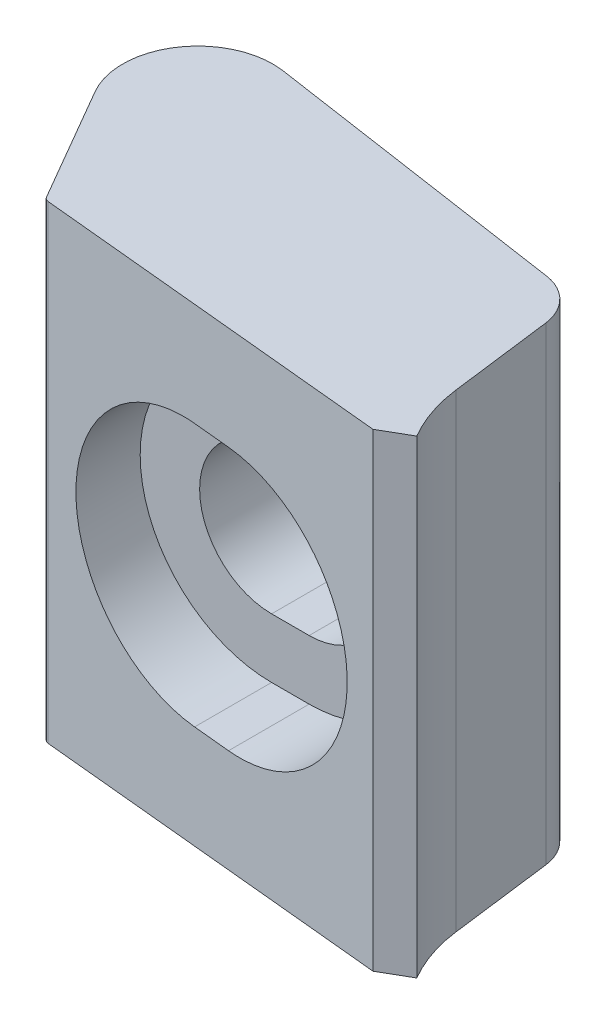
ISO-10303-21;
HEADER;
FILE_DESCRIPTION(('STEP AP214'),'2;1');
FILE_NAME('part.step','',(''),(''),'','','');
FILE_SCHEMA(('AUTOMOTIVE_DESIGN { 1 0 10303 214 1 1 1 1 }'));
ENDSEC;
DATA;
#1=APPLICATION_CONTEXT('core data for automotive mechanical design processes');
#2=APPLICATION_PROTOCOL_DEFINITION('international standard','automotive_design',2000,#1);
#3=PRODUCT_CONTEXT('',#1,'mechanical');
#4=PRODUCT('Part','Part','',(#3));
#5=PRODUCT_RELATED_PRODUCT_CATEGORY('part','',(#4));
#6=PRODUCT_DEFINITION_FORMATION('','',#4);
#7=PRODUCT_DEFINITION_CONTEXT('part definition',#1,'design');
#8=PRODUCT_DEFINITION('design','',#6,#7);
#9=PRODUCT_DEFINITION_SHAPE('','',#8);
#10=(LENGTH_UNIT() NAMED_UNIT(*) SI_UNIT(.MILLI.,.METRE.));
#11=(NAMED_UNIT(*) PLANE_ANGLE_UNIT() SI_UNIT($,.RADIAN.));
#12=(NAMED_UNIT(*) SI_UNIT($,.STERADIAN.) SOLID_ANGLE_UNIT());
#13=UNCERTAINTY_MEASURE_WITH_UNIT(LENGTH_MEASURE(1.E-05),#10,'distance_accuracy_value','');
#14=(GEOMETRIC_REPRESENTATION_CONTEXT(3) GLOBAL_UNCERTAINTY_ASSIGNED_CONTEXT((#13)) GLOBAL_UNIT_ASSIGNED_CONTEXT((#10,
#11,#12)) REPRESENTATION_CONTEXT('',''));
#15=CARTESIAN_POINT('',(0.,0.,0.));
#16=DIRECTION('',(0.,0.,1.));
#17=DIRECTION('',(1.,0.,0.));
#18=AXIS2_PLACEMENT_3D('',#15,#16,#17);
#19=CARTESIAN_POINT('',(6.5478797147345,4.7625,3.47218));
#20=DIRECTION('',(0.,-1.,0.));
#21=DIRECTION('',(1.,0.,0.));
#22=AXIS2_PLACEMENT_3D('',#19,#20,#21);
#23=CYLINDRICAL_SURFACE('',#22,3.175);
#24=CARTESIAN_POINT('',(6.5478797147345,-4.7625,3.47218));
#25=DIRECTION('',(0.,-1.,0.));
#26=DIRECTION('',(-1.,0.,0.));
#27=AXIS2_PLACEMENT_3D('',#24,#25,#26);
#28=CIRCLE('',#27,3.175);
#29=CARTESIAN_POINT('',(3.81,-4.7625,5.07986145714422));
#30=VERTEX_POINT('',#29);
#31=CARTESIAN_POINT('',(3.39844189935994,-4.7625,3.87425766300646));
#32=VERTEX_POINT('',#31);
#33=EDGE_CURVE('E185',#30,#32,#28,.T.);
#34=ORIENTED_EDGE('',*,*,#33,.T.);
#35=DIRECTION('',(0.,-1.,0.));
#36=VECTOR('',#35,1.);
#37=CARTESIAN_POINT('',(3.39844189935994,4.7625,3.87425766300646));
#38=LINE('',#37,#36);
#39=CARTESIAN_POINT('',(3.39844189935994,4.7625,3.87425766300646));
#40=VERTEX_POINT('',#39);
#41=EDGE_CURVE('E251',#40,#32,#38,.T.);
#42=ORIENTED_EDGE('',*,*,#41,.F.);
#43=CARTESIAN_POINT('',(6.5478797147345,4.7625,3.47218));
#44=DIRECTION('',(0.,-1.,0.));
#45=DIRECTION('',(-1.,0.,0.));
#46=AXIS2_PLACEMENT_3D('',#43,#44,#45);
#47=CIRCLE('',#46,3.175);
#48=CARTESIAN_POINT('',(3.81,4.7625,5.07986145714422));
#49=VERTEX_POINT('',#48);
#50=EDGE_CURVE('E213',#49,#40,#47,.T.);
#51=ORIENTED_EDGE('',*,*,#50,.F.);
#52=DIRECTION('',(0.,-1.,0.));
#53=VECTOR('',#52,1.);
#54=CARTESIAN_POINT('',(3.81,4.7625,5.07986145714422));
#55=LINE('',#54,#53);
#56=EDGE_CURVE('E254',#49,#30,#55,.T.);
#57=ORIENTED_EDGE('',*,*,#56,.T.);
#58=EDGE_LOOP('',(#34,#42,#51,#57));
#59=FACE_BOUND('',#58,.T.);
#60=ADVANCED_FACE('F14',(#59),#23,.F.);
#61=CARTESIAN_POINT('',(3.39844189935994,4.7625,3.87425766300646));
#62=DIRECTION('',(-0.991948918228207,0.,0.126638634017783));
#63=DIRECTION('',(0.126638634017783,0.,0.991948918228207));
#64=AXIS2_PLACEMENT_3D('',#61,#62,#63);
#65=PLANE('',#64);
#66=DIRECTION('',(-0.126638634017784,0.,-0.991948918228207));
#67=VECTOR('',#66,1.);
#68=CARTESIAN_POINT('',(3.39844189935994,-4.7625,3.87425766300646));
#69=LINE('',#68,#67);
#70=CARTESIAN_POINT('',(3.13142881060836,-4.7625,1.78276839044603));
#71=VERTEX_POINT('',#70);
#72=EDGE_CURVE('E194',#32,#71,#69,.T.);
#73=ORIENTED_EDGE('',*,*,#72,.T.);
#74=DIRECTION('',(0.,-1.,0.));
#75=VECTOR('',#74,1.);
#76=CARTESIAN_POINT('',(3.13142881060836,4.7625,1.78276839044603));
#77=LINE('',#76,#75);
#78=CARTESIAN_POINT('',(3.13142881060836,4.7625,1.78276839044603));
#79=VERTEX_POINT('',#78);
#80=EDGE_CURVE('E248',#79,#71,#77,.T.);
#81=ORIENTED_EDGE('',*,*,#80,.F.);
#82=DIRECTION('',(-0.126638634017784,0.,-0.991948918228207));
#83=VECTOR('',#82,1.);
#84=CARTESIAN_POINT('',(3.39844189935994,4.7625,3.87425766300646));
#85=LINE('',#84,#83);
#86=EDGE_CURVE('E215',#40,#79,#85,.T.);
#87=ORIENTED_EDGE('',*,*,#86,.F.);
#88=ORIENTED_EDGE('',*,*,#41,.T.);
#89=EDGE_LOOP('',(#73,#81,#87,#88));
#90=FACE_BOUND('',#89,.T.);
#91=ADVANCED_FACE('F292',(#90),#65,.F.);
#92=CARTESIAN_POINT('',(2.1739997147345,4.7625,1.905));
#93=DIRECTION('',(0.,-1.,0.));
#94=DIRECTION('',(1.,0.,0.));
#95=AXIS2_PLACEMENT_3D('',#92,#93,#94);
#96=CYLINDRICAL_SURFACE('',#95,0.9652);
#97=CARTESIAN_POINT('',(2.1739997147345,-4.7625,1.905));
#98=DIRECTION('',(0.,1.,0.));
#99=DIRECTION('',(-1.,0.,0.));
#100=AXIS2_PLACEMENT_3D('',#97,#98,#99);
#101=CIRCLE('',#100,0.9652);
#102=CARTESIAN_POINT('',(2.31587971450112,-4.7625,0.95028480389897));
#103=VERTEX_POINT('',#102);
#104=EDGE_CURVE('E196',#71,#103,#101,.T.);
#105=ORIENTED_EDGE('',*,*,#104,.T.);
#106=DIRECTION('',(0.,-1.,0.));
#107=VECTOR('',#106,1.);
#108=CARTESIAN_POINT('',(2.31587971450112,4.7625,0.95028480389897));
#109=LINE('',#108,#107);
#110=CARTESIAN_POINT('',(2.31587971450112,4.7625,0.95028480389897));
#111=VERTEX_POINT('',#110);
#112=EDGE_CURVE('E245',#111,#103,#109,.T.);
#113=ORIENTED_EDGE('',*,*,#112,.F.);
#114=CARTESIAN_POINT('',(2.1739997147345,4.7625,1.905));
#115=DIRECTION('',(0.,1.,0.));
#116=DIRECTION('',(-1.,0.,0.));
#117=AXIS2_PLACEMENT_3D('',#114,#115,#116);
#118=CIRCLE('',#117,0.9652);
#119=EDGE_CURVE('E217',#79,#111,#118,.T.);
#120=ORIENTED_EDGE('',*,*,#119,.F.);
#121=ORIENTED_EDGE('',*,*,#80,.T.);
#122=EDGE_LOOP('',(#105,#113,#120,#121));
#123=FACE_BOUND('',#122,.T.);
#124=ADVANCED_FACE('F298',(#123),#96,.T.);
#125=CARTESIAN_POINT('',(-3.96721923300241,4.7625,0.0165549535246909));
#126=DIRECTION('',(-0.146995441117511,0.,0.98913716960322));
#127=DIRECTION('',(0.98913716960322,0.,0.146995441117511));
#128=AXIS2_PLACEMENT_3D('',#125,#126,#127);
#129=PLANE('',#128);
#130=DIRECTION('',(0.98913716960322,0.,0.146995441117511));
#131=VECTOR('',#130,1.);
#132=CARTESIAN_POINT('',(-3.96721923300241,-1.4605,0.0165549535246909));
#133=LINE('',#132,#131);
#134=CARTESIAN_POINT('',(-0.762,-1.4605,0.492881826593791));
#135=VERTEX_POINT('',#134);
#136=CARTESIAN_POINT('',(0.,-1.4605,0.606122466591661));
#137=VERTEX_POINT('',#136);
#138=EDGE_CURVE('E163',#135,#137,#133,.T.);
#139=ORIENTED_EDGE('',*,*,#138,.T.);
#140=CARTESIAN_POINT('',(0.,0.,0.606122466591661));
#141=DIRECTION('',(-0.146995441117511,0.,0.98913716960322));
#142=DIRECTION('',(0.98913716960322,0.,0.146995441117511));
#143=AXIS2_PLACEMENT_3D('',#140,#141,#142);
#144=ELLIPSE('',#143,1.47653939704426,1.4605);
#145=CARTESIAN_POINT('',(0.,1.4605,0.606122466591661));
#146=VERTEX_POINT('',#145);
#147=EDGE_CURVE('E166',#137,#146,#144,.T.);
#148=ORIENTED_EDGE('',*,*,#147,.T.);
#149=DIRECTION('',(-0.98913716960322,0.,-0.146995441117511));
#150=VECTOR('',#149,1.);
#151=CARTESIAN_POINT('',(-3.96721923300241,1.4605,0.0165549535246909));
#152=LINE('',#151,#150);
#153=CARTESIAN_POINT('',(-0.762,1.4605,0.492881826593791));
#154=VERTEX_POINT('',#153);
#155=EDGE_CURVE('E158',#146,#154,#152,.T.);
#156=ORIENTED_EDGE('',*,*,#155,.T.);
#157=CARTESIAN_POINT('',(-0.762,0.,0.492881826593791));
#158=DIRECTION('',(-0.146995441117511,0.,0.98913716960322));
#159=DIRECTION('',(0.98913716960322,0.,0.146995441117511));
#160=AXIS2_PLACEMENT_3D('',#157,#158,#159);
#161=ELLIPSE('',#160,1.47653939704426,1.4605);
#162=EDGE_CURVE('E138',#154,#135,#161,.T.);
#163=ORIENTED_EDGE('',*,*,#162,.T.);
#164=EDGE_LOOP('',(#139,#148,#156,#163));
#165=FACE_BOUND('',#164,.T.);
#166=DIRECTION('',(-0.98913716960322,0.,-0.146995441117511));
#167=VECTOR('',#166,1.);
#168=CARTESIAN_POINT('',(-3.96721923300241,-4.7625,0.0165549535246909));
#169=LINE('',#168,#167);
#170=CARTESIAN_POINT('',(-3.96721923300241,-4.7625,0.0165549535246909));
#171=VERTEX_POINT('',#170);
#172=EDGE_CURVE('E198',#103,#171,#169,.T.);
#173=ORIENTED_EDGE('',*,*,#172,.T.);
#174=DIRECTION('',(0.,-1.,0.));
#175=VECTOR('',#174,1.);
#176=CARTESIAN_POINT('',(-3.96721923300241,4.7625,0.0165549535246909));
#177=LINE('',#176,#175);
#178=CARTESIAN_POINT('',(-3.96721923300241,4.7625,0.0165549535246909));
#179=VERTEX_POINT('',#178);
#180=EDGE_CURVE('E242',#179,#171,#177,.T.);
#181=ORIENTED_EDGE('',*,*,#180,.F.);
#182=DIRECTION('',(-0.98913716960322,0.,-0.146995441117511));
#183=VECTOR('',#182,1.);
#184=CARTESIAN_POINT('',(-3.96721923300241,4.7625,0.0165549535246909));
#185=LINE('',#184,#183);
#186=EDGE_CURVE('E219',#111,#179,#185,.T.);
#187=ORIENTED_EDGE('',*,*,#186,.F.);
#188=ORIENTED_EDGE('',*,*,#112,.T.);
#189=EDGE_LOOP('',(#173,#181,#187,#188));
#190=FACE_BOUND('',#189,.T.);
#191=ADVANCED_FACE('F317',(#165,#190),#129,.F.);
#192=CARTESIAN_POINT('',(-4.1912402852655,4.7625,1.524));
#193=DIRECTION('',(0.,-1.,0.));
#194=DIRECTION('',(1.,0.,0.));
#195=AXIS2_PLACEMENT_3D('',#192,#193,#194);
#196=CYLINDRICAL_SURFACE('',#195,1.524);
#197=CARTESIAN_POINT('',(-4.1912402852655,-4.7625,1.524));
#198=DIRECTION('',(0.,1.,0.));
#199=DIRECTION('',(-1.,0.,0.));
#200=AXIS2_PLACEMENT_3D('',#197,#198,#199);
#201=CIRCLE('',#200,1.524);
#202=CARTESIAN_POINT('',(-5.50966221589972,-4.7625,2.28842109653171));
#203=VERTEX_POINT('',#202);
#204=EDGE_CURVE('E200',#171,#203,#201,.T.);
#205=ORIENTED_EDGE('',*,*,#204,.T.);
#206=DIRECTION('',(0.,-1.,0.));
#207=VECTOR('',#206,1.);
#208=CARTESIAN_POINT('',(-5.50966221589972,4.7625,2.28842109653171));
#209=LINE('',#208,#207);
#210=CARTESIAN_POINT('',(-5.50966221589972,4.7625,2.28842109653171));
#211=VERTEX_POINT('',#210);
#212=EDGE_CURVE('E239',#211,#203,#209,.T.);
#213=ORIENTED_EDGE('',*,*,#212,.F.);
#214=CARTESIAN_POINT('',(-4.1912402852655,4.7625,1.524));
#215=DIRECTION('',(0.,1.,0.));
#216=DIRECTION('',(-1.,0.,0.));
#217=AXIS2_PLACEMENT_3D('',#214,#215,#216);
#218=CIRCLE('',#217,1.524);
#219=EDGE_CURVE('E221',#179,#211,#218,.T.);
#220=ORIENTED_EDGE('',*,*,#219,.F.);
#221=ORIENTED_EDGE('',*,*,#180,.T.);
#222=EDGE_LOOP('',(#205,#213,#220,#221));
#223=FACE_BOUND('',#222,.T.);
#224=ADVANCED_FACE('F339',(#223),#196,.T.);
#225=CARTESIAN_POINT('',(-4.14870877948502,4.7625,4.63570175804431));
#226=DIRECTION('',(0.865106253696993,0.,-0.501588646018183));
#227=DIRECTION('',(-0.501588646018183,0.,-0.865106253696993));
#228=AXIS2_PLACEMENT_3D('',#225,#226,#227);
#229=PLANE('',#228);
#230=DIRECTION('',(0.501588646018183,0.,0.865106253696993));
#231=VECTOR('',#230,1.);
#232=CARTESIAN_POINT('',(-4.14870877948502,-4.7625,4.63570175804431));
#233=LINE('',#232,#231);
#234=CARTESIAN_POINT('',(-4.14870877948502,-4.7625,4.63570175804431));
#235=VERTEX_POINT('',#234);
#236=EDGE_CURVE('E202',#203,#235,#233,.T.);
#237=ORIENTED_EDGE('',*,*,#236,.T.);
#238=DIRECTION('',(0.,-1.,0.));
#239=VECTOR('',#238,1.);
#240=CARTESIAN_POINT('',(-4.14870877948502,4.7625,4.63570175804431));
#241=LINE('',#240,#239);
#242=CARTESIAN_POINT('',(-4.14870877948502,4.7625,4.63570175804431));
#243=VERTEX_POINT('',#242);
#244=EDGE_CURVE('E236',#243,#235,#241,.T.);
#245=ORIENTED_EDGE('',*,*,#244,.F.);
#246=DIRECTION('',(0.501588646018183,0.,0.865106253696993));
#247=VECTOR('',#246,1.);
#248=CARTESIAN_POINT('',(-4.14870877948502,4.7625,4.63570175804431));
#249=LINE('',#248,#247);
#250=EDGE_CURVE('E223',#211,#243,#249,.T.);
#251=ORIENTED_EDGE('',*,*,#250,.F.);
#252=ORIENTED_EDGE('',*,*,#212,.T.);
#253=EDGE_LOOP('',(#237,#245,#251,#252));
#254=FACE_BOUND('',#253,.T.);
#255=ADVANCED_FACE('F337',(#254),#229,.F.);
#256=CARTESIAN_POINT('',(-4.0388402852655,4.7625,4.572));
#257=DIRECTION('',(0.,-1.,0.));
#258=DIRECTION('',(1.,0.,0.));
#259=AXIS2_PLACEMENT_3D('',#256,#257,#258);
#260=CYLINDRICAL_SURFACE('',#259,0.127);
#261=CARTESIAN_POINT('',(-4.0388402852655,-4.7625,4.572));
#262=DIRECTION('',(0.,1.,0.));
#263=DIRECTION('',(-1.,0.,0.));
#264=AXIS2_PLACEMENT_3D('',#261,#262,#263);
#265=CIRCLE('',#264,0.127);
#266=CARTESIAN_POINT('',(-4.05108296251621,-4.7625,4.6984085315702));
#267=VERTEX_POINT('',#266);
#268=EDGE_CURVE('E204',#235,#267,#265,.T.);
#269=ORIENTED_EDGE('',*,*,#268,.T.);
#270=DIRECTION('',(0.,-1.,0.));
#271=VECTOR('',#270,1.);
#272=CARTESIAN_POINT('',(-4.05108296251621,4.7625,4.6984085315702));
#273=LINE('',#272,#271);
#274=CARTESIAN_POINT('',(-4.05108296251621,4.7625,4.6984085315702));
#275=VERTEX_POINT('',#274);
#276=EDGE_CURVE('E233',#275,#267,#273,.T.);
#277=ORIENTED_EDGE('',*,*,#276,.F.);
#278=CARTESIAN_POINT('',(-4.0388402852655,4.7625,4.572));
#279=DIRECTION('',(0.,1.,0.));
#280=DIRECTION('',(-1.,0.,0.));
#281=AXIS2_PLACEMENT_3D('',#278,#279,#280);
#282=CIRCLE('',#281,0.127);
#283=EDGE_CURVE('E225',#243,#275,#282,.T.);
#284=ORIENTED_EDGE('',*,*,#283,.F.);
#285=ORIENTED_EDGE('',*,*,#244,.T.);
#286=EDGE_LOOP('',(#269,#277,#284,#285));
#287=FACE_BOUND('',#286,.T.);
#288=ADVANCED_FACE('F333',(#287),#260,.T.);
#289=CARTESIAN_POINT('',(-4.05108296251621,4.7625,4.6984085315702));
#290=DIRECTION('',(0.0963990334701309,0.,-0.995342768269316));
#291=DIRECTION('',(-0.995342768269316,0.,-0.0963990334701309));
#292=AXIS2_PLACEMENT_3D('',#289,#290,#291);
#293=PLANE('',#292);
#294=DIRECTION('',(0.995342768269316,0.,0.0963990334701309));
#295=VECTOR('',#294,1.);
#296=CARTESIAN_POINT('',(-4.05108296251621,2.667,4.6984085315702));
#297=LINE('',#296,#295);
#298=CARTESIAN_POINT('',(-0.762,2.667,5.01695650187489));
#299=VERTEX_POINT('',#298);
#300=CARTESIAN_POINT('',(0.,2.667,5.09075626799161));
#301=VERTEX_POINT('',#300);
#302=EDGE_CURVE('E257',#299,#301,#297,.T.);
#303=ORIENTED_EDGE('',*,*,#302,.T.);
#304=CARTESIAN_POINT('',(0.,0.,5.09075626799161));
#305=DIRECTION('',(0.0963990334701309,0.,-0.995342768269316));
#306=DIRECTION('',(0.995342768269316,0.,0.0963990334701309));
#307=AXIS2_PLACEMENT_3D('',#304,#305,#306);
#308=ELLIPSE('',#307,2.67947895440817,2.667);
#309=CARTESIAN_POINT('',(0.,-2.667,5.09075626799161));
#310=VERTEX_POINT('',#309);
#311=EDGE_CURVE('E9',#301,#310,#308,.T.);
#312=ORIENTED_EDGE('',*,*,#311,.T.);
#313=DIRECTION('',(-0.995342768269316,0.,-0.0963990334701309));
#314=VECTOR('',#313,1.);
#315=CARTESIAN_POINT('',(-4.05108296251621,-2.667,4.6984085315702));
#316=LINE('',#315,#314);
#317=CARTESIAN_POINT('',(-0.762,-2.667,5.01695650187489));
#318=VERTEX_POINT('',#317);
#319=EDGE_CURVE('E21',#310,#318,#316,.T.);
#320=ORIENTED_EDGE('',*,*,#319,.T.);
#321=CARTESIAN_POINT('',(-0.762,0.,5.01695650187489));
#322=DIRECTION('',(0.0963990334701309,0.,-0.995342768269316));
#323=DIRECTION('',(0.995342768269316,0.,0.0963990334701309));
#324=AXIS2_PLACEMENT_3D('',#321,#322,#323);
#325=ELLIPSE('',#324,2.67947895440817,2.667);
#326=EDGE_CURVE('E260',#318,#299,#325,.T.);
#327=ORIENTED_EDGE('',*,*,#326,.T.);
#328=EDGE_LOOP('',(#303,#312,#320,#327));
#329=FACE_BOUND('',#328,.T.);
#330=DIRECTION('',(0.995342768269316,0.,0.096399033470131));
#331=VECTOR('',#330,1.);
#332=CARTESIAN_POINT('',(-4.05108296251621,-4.7625,4.6984085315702));
#333=LINE('',#332,#331);
#334=CARTESIAN_POINT('',(3.2458797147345,-4.7625,5.40512));
#335=VERTEX_POINT('',#334);
#336=EDGE_CURVE('E206',#267,#335,#333,.T.);
#337=ORIENTED_EDGE('',*,*,#336,.T.);
#338=DIRECTION('',(0.,-1.,0.));
#339=VECTOR('',#338,1.);
#340=CARTESIAN_POINT('',(3.2458797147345,4.7625,5.40512));
#341=LINE('',#340,#339);
#342=CARTESIAN_POINT('',(3.2458797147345,4.7625,5.40512));
#343=VERTEX_POINT('',#342);
#344=EDGE_CURVE('E230',#343,#335,#341,.T.);
#345=ORIENTED_EDGE('',*,*,#344,.F.);
#346=DIRECTION('',(0.995342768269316,0.,0.096399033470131));
#347=VECTOR('',#346,1.);
#348=CARTESIAN_POINT('',(-4.05108296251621,4.7625,4.6984085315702));
#349=LINE('',#348,#347);
#350=EDGE_CURVE('E227',#275,#343,#349,.T.);
#351=ORIENTED_EDGE('',*,*,#350,.F.);
#352=ORIENTED_EDGE('',*,*,#276,.T.);
#353=EDGE_LOOP('',(#337,#345,#351,#352));
#354=FACE_BOUND('',#353,.T.);
#355=ADVANCED_FACE('F264',(#329,#354),#293,.F.);
#356=CARTESIAN_POINT('',(3.2458797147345,4.7625,5.40512));
#357=DIRECTION('',(-0.499497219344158,0.,-0.866315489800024));
#358=DIRECTION('',(-0.866315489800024,0.,0.499497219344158));
#359=AXIS2_PLACEMENT_3D('',#356,#357,#358);
#360=PLANE('',#359);
#361=DIRECTION('',(0.866315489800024,0.,-0.499497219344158));
#362=VECTOR('',#361,1.);
#363=CARTESIAN_POINT('',(3.2458797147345,-4.7625,5.40512));
#364=LINE('',#363,#362);
#365=EDGE_CURVE('E208',#335,#30,#364,.T.);
#366=ORIENTED_EDGE('',*,*,#365,.T.);
#367=ORIENTED_EDGE('',*,*,#56,.F.);
#368=DIRECTION('',(0.866315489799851,0.,-0.499497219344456));
#369=VECTOR('',#368,1.);
#370=CARTESIAN_POINT('',(3.8097597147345,4.7625,5.08));
#371=LINE('',#370,#369);
#372=EDGE_CURVE('E210',#343,#49,#371,.T.);
#373=ORIENTED_EDGE('',*,*,#372,.F.);
#374=ORIENTED_EDGE('',*,*,#344,.T.);
#375=EDGE_LOOP('',(#366,#367,#373,#374));
#376=FACE_BOUND('',#375,.T.);
#377=ADVANCED_FACE('F326',(#376),#360,.F.);
#378=CARTESIAN_POINT('',(6.5478797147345,4.7625,3.47218));
#379=DIRECTION('',(0.,1.,0.));
#380=DIRECTION('',(-1.,0.,0.));
#381=AXIS2_PLACEMENT_3D('',#378,#379,#380);
#382=PLANE('',#381);
#383=ORIENTED_EDGE('',*,*,#372,.T.);
#384=ORIENTED_EDGE('',*,*,#50,.T.);
#385=ORIENTED_EDGE('',*,*,#86,.T.);
#386=ORIENTED_EDGE('',*,*,#119,.T.);
#387=ORIENTED_EDGE('',*,*,#186,.T.);
#388=ORIENTED_EDGE('',*,*,#219,.T.);
#389=ORIENTED_EDGE('',*,*,#250,.T.);
#390=ORIENTED_EDGE('',*,*,#283,.T.);
#391=ORIENTED_EDGE('',*,*,#350,.T.);
#392=EDGE_LOOP('',(#383,#384,#385,#386,#387,#388,#389,#390,#391));
#393=FACE_BOUND('',#392,.T.);
#394=ADVANCED_FACE('F321',(#393),#382,.T.);
#395=CARTESIAN_POINT('',(6.5478797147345,-4.7625,3.47218));
#396=DIRECTION('',(0.,1.,0.));
#397=DIRECTION('',(-1.,0.,0.));
#398=AXIS2_PLACEMENT_3D('',#395,#396,#397);
#399=PLANE('',#398);
#400=ORIENTED_EDGE('',*,*,#33,.F.);
#401=ORIENTED_EDGE('',*,*,#365,.F.);
#402=ORIENTED_EDGE('',*,*,#336,.F.);
#403=ORIENTED_EDGE('',*,*,#268,.F.);
#404=ORIENTED_EDGE('',*,*,#236,.F.);
#405=ORIENTED_EDGE('',*,*,#204,.F.);
#406=ORIENTED_EDGE('',*,*,#172,.F.);
#407=ORIENTED_EDGE('',*,*,#104,.F.);
#408=ORIENTED_EDGE('',*,*,#72,.F.);
#409=EDGE_LOOP('',(#400,#401,#402,#403,#404,#405,#406,#407,#408));
#410=FACE_BOUND('',#409,.T.);
#411=ADVANCED_FACE('F309',(#410),#399,.F.);
#412=CARTESIAN_POINT('',(0.,0.,3.4544));
#413=DIRECTION('',(0.,0.,1.));
#414=DIRECTION('',(0.,1.,0.));
#415=AXIS2_PLACEMENT_3D('',#412,#413,#414);
#416=CYLINDRICAL_SURFACE('',#415,2.667);
#417=DIRECTION('',(0.,0.,1.));
#418=VECTOR('',#417,1.);
#419=CARTESIAN_POINT('',(0.,2.667,3.4544));
#420=LINE('',#419,#418);
#421=CARTESIAN_POINT('',(0.,2.667,3.4544));
#422=VERTEX_POINT('',#421);
#423=EDGE_CURVE('E181',#422,#301,#420,.T.);
#424=ORIENTED_EDGE('',*,*,#423,.F.);
#425=CARTESIAN_POINT('',(0.,0.,3.4544));
#426=DIRECTION('',(0.,0.,1.));
#427=DIRECTION('',(0.,1.,0.));
#428=AXIS2_PLACEMENT_3D('',#425,#426,#427);
#429=CIRCLE('',#428,2.667);
#430=CARTESIAN_POINT('',(0.,-2.667,3.4544));
#431=VERTEX_POINT('',#430);
#432=EDGE_CURVE('E169',#431,#422,#429,.T.);
#433=ORIENTED_EDGE('',*,*,#432,.F.);
#434=DIRECTION('',(0.,0.,1.));
#435=VECTOR('',#434,1.);
#436=CARTESIAN_POINT('',(0.,-2.667,3.4544));
#437=LINE('',#436,#435);
#438=EDGE_CURVE('E182',#431,#310,#437,.T.);
#439=ORIENTED_EDGE('',*,*,#438,.T.);
#440=ORIENTED_EDGE('',*,*,#311,.F.);
#441=EDGE_LOOP('',(#424,#433,#439,#440));
#442=FACE_BOUND('',#441,.T.);
#443=ADVANCED_FACE('F272',(#442),#416,.F.);
#444=CARTESIAN_POINT('',(-0.762,-2.667,3.4544));
#445=DIRECTION('',(0.,-1.,0.));
#446=DIRECTION('',(1.,0.,0.));
#447=AXIS2_PLACEMENT_3D('',#444,#445,#446);
#448=PLANE('',#447);
#449=ORIENTED_EDGE('',*,*,#438,.F.);
#450=DIRECTION('',(1.,0.,0.));
#451=VECTOR('',#450,1.);
#452=CARTESIAN_POINT('',(-0.762,-2.667,3.4544));
#453=LINE('',#452,#451);
#454=CARTESIAN_POINT('',(-0.762,-2.667,3.4544));
#455=VERTEX_POINT('',#454);
#456=EDGE_CURVE('E178',#455,#431,#453,.T.);
#457=ORIENTED_EDGE('',*,*,#456,.F.);
#458=DIRECTION('',(0.,0.,1.));
#459=VECTOR('',#458,1.);
#460=CARTESIAN_POINT('',(-0.762,-2.667,3.4544));
#461=LINE('',#460,#459);
#462=EDGE_CURVE('E186',#455,#318,#461,.T.);
#463=ORIENTED_EDGE('',*,*,#462,.T.);
#464=ORIENTED_EDGE('',*,*,#319,.F.);
#465=EDGE_LOOP('',(#449,#457,#463,#464));
#466=FACE_BOUND('',#465,.T.);
#467=ADVANCED_FACE('F268',(#466),#448,.F.);
#468=CARTESIAN_POINT('',(-0.762,0.,3.4544));
#469=DIRECTION('',(0.,0.,1.));
#470=DIRECTION('',(0.,1.,0.));
#471=AXIS2_PLACEMENT_3D('',#468,#469,#470);
#472=CYLINDRICAL_SURFACE('',#471,2.667);
#473=ORIENTED_EDGE('',*,*,#462,.F.);
#474=CARTESIAN_POINT('',(-0.762,0.,3.4544));
#475=DIRECTION('',(0.,0.,1.));
#476=DIRECTION('',(0.,1.,0.));
#477=AXIS2_PLACEMENT_3D('',#474,#475,#476);
#478=CIRCLE('',#477,2.667);
#479=CARTESIAN_POINT('',(-0.762,2.667,3.4544));
#480=VERTEX_POINT('',#479);
#481=EDGE_CURVE('E175',#480,#455,#478,.T.);
#482=ORIENTED_EDGE('',*,*,#481,.F.);
#483=DIRECTION('',(0.,0.,1.));
#484=VECTOR('',#483,1.);
#485=CARTESIAN_POINT('',(-0.762,2.667,3.4544));
#486=LINE('',#485,#484);
#487=EDGE_CURVE('E189',#480,#299,#486,.T.);
#488=ORIENTED_EDGE('',*,*,#487,.T.);
#489=ORIENTED_EDGE('',*,*,#326,.F.);
#490=EDGE_LOOP('',(#473,#482,#488,#489));
#491=FACE_BOUND('',#490,.T.);
#492=ADVANCED_FACE('F276',(#491),#472,.F.);
#493=CARTESIAN_POINT('',(0.,2.667,3.4544));
#494=DIRECTION('',(0.,1.,0.));
#495=DIRECTION('',(-1.,0.,0.));
#496=AXIS2_PLACEMENT_3D('',#493,#494,#495);
#497=PLANE('',#496);
#498=ORIENTED_EDGE('',*,*,#487,.F.);
#499=DIRECTION('',(-1.,0.,0.));
#500=VECTOR('',#499,1.);
#501=CARTESIAN_POINT('',(0.,2.667,3.4544));
#502=LINE('',#501,#500);
#503=EDGE_CURVE('E172',#422,#480,#502,.T.);
#504=ORIENTED_EDGE('',*,*,#503,.F.);
#505=ORIENTED_EDGE('',*,*,#423,.T.);
#506=ORIENTED_EDGE('',*,*,#302,.F.);
#507=EDGE_LOOP('',(#498,#504,#505,#506));
#508=FACE_BOUND('',#507,.T.);
#509=ADVANCED_FACE('F278',(#508),#497,.F.);
#510=CARTESIAN_POINT('',(0.,0.,3.4544));
#511=DIRECTION('',(0.,0.,1.));
#512=DIRECTION('',(0.,1.,0.));
#513=AXIS2_PLACEMENT_3D('',#510,#511,#512);
#514=PLANE('',#513);
#515=CARTESIAN_POINT('',(0.,0.,3.4544));
#516=DIRECTION('',(0.,0.,1.));
#517=DIRECTION('',(0.,1.,0.));
#518=AXIS2_PLACEMENT_3D('',#515,#516,#517);
#519=CIRCLE('',#518,1.4605);
#520=CARTESIAN_POINT('',(0.,-1.4605,3.4544));
#521=VERTEX_POINT('',#520);
#522=CARTESIAN_POINT('',(0.,1.4605,3.4544));
#523=VERTEX_POINT('',#522);
#524=EDGE_CURVE('E36',#521,#523,#519,.T.);
#525=ORIENTED_EDGE('',*,*,#524,.F.);
#526=DIRECTION('',(1.,0.,0.));
#527=VECTOR('',#526,1.);
#528=CARTESIAN_POINT('',(-0.762,-1.4605,3.4544));
#529=LINE('',#528,#527);
#530=CARTESIAN_POINT('',(-0.762,-1.4605,3.4544));
#531=VERTEX_POINT('',#530);
#532=EDGE_CURVE('E151',#531,#521,#529,.T.);
#533=ORIENTED_EDGE('',*,*,#532,.F.);
#534=CARTESIAN_POINT('',(-0.762,0.,3.4544));
#535=DIRECTION('',(0.,0.,1.));
#536=DIRECTION('',(0.,1.,0.));
#537=AXIS2_PLACEMENT_3D('',#534,#535,#536);
#538=CIRCLE('',#537,1.4605);
#539=CARTESIAN_POINT('',(-0.762,1.4605,3.4544));
#540=VERTEX_POINT('',#539);
#541=EDGE_CURVE('E135',#540,#531,#538,.T.);
#542=ORIENTED_EDGE('',*,*,#541,.F.);
#543=DIRECTION('',(-1.,0.,0.));
#544=VECTOR('',#543,1.);
#545=CARTESIAN_POINT('',(-0.762,1.4605,3.4544));
#546=LINE('',#545,#544);
#547=EDGE_CURVE('E144',#523,#540,#546,.T.);
#548=ORIENTED_EDGE('',*,*,#547,.F.);
#549=EDGE_LOOP('',(#525,#533,#542,#548));
#550=FACE_BOUND('',#549,.T.);
#551=ORIENTED_EDGE('',*,*,#432,.T.);
#552=ORIENTED_EDGE('',*,*,#503,.T.);
#553=ORIENTED_EDGE('',*,*,#481,.T.);
#554=ORIENTED_EDGE('',*,*,#456,.T.);
#555=EDGE_LOOP('',(#551,#552,#553,#554));
#556=FACE_BOUND('',#555,.T.);
#557=ADVANCED_FACE('F148',(#550,#556),#514,.T.);
#558=CARTESIAN_POINT('',(0.,0.,0.));
#559=DIRECTION('',(0.,0.,1.));
#560=DIRECTION('',(0.,1.,0.));
#561=AXIS2_PLACEMENT_3D('',#558,#559,#560);
#562=CYLINDRICAL_SURFACE('',#561,1.4605);
#563=DIRECTION('',(0.,0.,1.));
#564=VECTOR('',#563,1.);
#565=CARTESIAN_POINT('',(0.,-1.4605,0.));
#566=LINE('',#565,#564);
#567=EDGE_CURVE('E156',#137,#521,#566,.T.);
#568=ORIENTED_EDGE('',*,*,#567,.T.);
#569=ORIENTED_EDGE('',*,*,#524,.T.);
#570=DIRECTION('',(0.,0.,1.));
#571=VECTOR('',#570,1.);
#572=CARTESIAN_POINT('',(0.,1.4605,0.));
#573=LINE('',#572,#571);
#574=EDGE_CURVE('E141',#146,#523,#573,.T.);
#575=ORIENTED_EDGE('',*,*,#574,.F.);
#576=ORIENTED_EDGE('',*,*,#147,.F.);
#577=EDGE_LOOP('',(#568,#569,#575,#576));
#578=FACE_BOUND('',#577,.T.);
#579=ADVANCED_FACE('F287',(#578),#562,.F.);
#580=CARTESIAN_POINT('',(-0.762,-1.4605,0.));
#581=DIRECTION('',(0.,-1.,0.));
#582=DIRECTION('',(1.,0.,0.));
#583=AXIS2_PLACEMENT_3D('',#580,#581,#582);
#584=PLANE('',#583);
#585=DIRECTION('',(0.,0.,1.));
#586=VECTOR('',#585,1.);
#587=CARTESIAN_POINT('',(-0.762,-1.4605,0.));
#588=LINE('',#587,#586);
#589=EDGE_CURVE('E140',#135,#531,#588,.T.);
#590=ORIENTED_EDGE('',*,*,#589,.T.);
#591=ORIENTED_EDGE('',*,*,#532,.T.);
#592=ORIENTED_EDGE('',*,*,#567,.F.);
#593=ORIENTED_EDGE('',*,*,#138,.F.);
#594=EDGE_LOOP('',(#590,#591,#592,#593));
#595=FACE_BOUND('',#594,.T.);
#596=ADVANCED_FACE('F415',(#595),#584,.F.);
#597=CARTESIAN_POINT('',(-0.762,0.,0.));
#598=DIRECTION('',(0.,0.,1.));
#599=DIRECTION('',(0.,1.,0.));
#600=AXIS2_PLACEMENT_3D('',#597,#598,#599);
#601=CYLINDRICAL_SURFACE('',#600,1.4605);
#602=DIRECTION('',(0.,0.,1.));
#603=VECTOR('',#602,1.);
#604=CARTESIAN_POINT('',(-0.762,1.4605,0.));
#605=LINE('',#604,#603);
#606=EDGE_CURVE('E28',#154,#540,#605,.T.);
#607=ORIENTED_EDGE('',*,*,#606,.T.);
#608=ORIENTED_EDGE('',*,*,#541,.T.);
#609=ORIENTED_EDGE('',*,*,#589,.F.);
#610=ORIENTED_EDGE('',*,*,#162,.F.);
#611=EDGE_LOOP('',(#607,#608,#609,#610));
#612=FACE_BOUND('',#611,.T.);
#613=ADVANCED_FACE('F132',(#612),#601,.F.);
#614=CARTESIAN_POINT('',(-0.762,1.4605,0.));
#615=DIRECTION('',(0.,1.,0.));
#616=DIRECTION('',(-1.,0.,0.));
#617=AXIS2_PLACEMENT_3D('',#614,#615,#616);
#618=PLANE('',#617);
#619=ORIENTED_EDGE('',*,*,#574,.T.);
#620=ORIENTED_EDGE('',*,*,#547,.T.);
#621=ORIENTED_EDGE('',*,*,#606,.F.);
#622=ORIENTED_EDGE('',*,*,#155,.F.);
#623=EDGE_LOOP('',(#619,#620,#621,#622));
#624=FACE_BOUND('',#623,.T.);
#625=ADVANCED_FACE('F145',(#624),#618,.F.);
#626=CLOSED_SHELL('',(#60,#91,#124,#191,#224,#255,#288,#355,#377,#394,#411,#443,#467,#492,#509,
#557,#579,#596,#613,#625));
#627=MANIFOLD_SOLID_BREP('B1',#626);
#628=ADVANCED_BREP_SHAPE_REPRESENTATION('',(#18,#627),#14);
#629=SHAPE_DEFINITION_REPRESENTATION(#9,#628);
ENDSEC;
END-ISO-10303-21;
